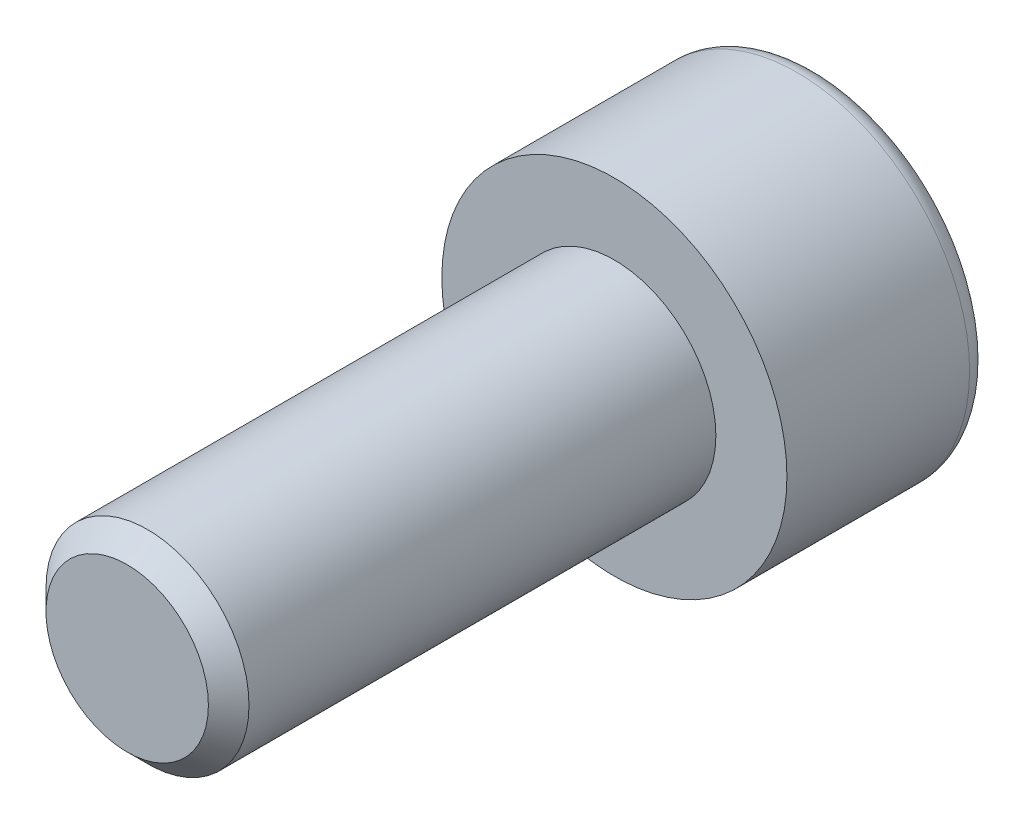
ISO-10303-21;
HEADER;
FILE_DESCRIPTION(('STEP AP214'),'2;1');
FILE_NAME('part.step','',(''),(''),'','','');
FILE_SCHEMA(('AUTOMOTIVE_DESIGN { 1 0 10303 214 1 1 1 1 }'));
ENDSEC;
DATA;
#1=APPLICATION_CONTEXT('core data for automotive mechanical design processes');
#2=APPLICATION_PROTOCOL_DEFINITION('international standard','automotive_design',2000,#1);
#3=PRODUCT_CONTEXT('',#1,'mechanical');
#4=PRODUCT('Part','Part','',(#3));
#5=PRODUCT_RELATED_PRODUCT_CATEGORY('part','',(#4));
#6=PRODUCT_DEFINITION_FORMATION('','',#4);
#7=PRODUCT_DEFINITION_CONTEXT('part definition',#1,'design');
#8=PRODUCT_DEFINITION('design','',#6,#7);
#9=PRODUCT_DEFINITION_SHAPE('','',#8);
#10=(LENGTH_UNIT() NAMED_UNIT(*) SI_UNIT(.MILLI.,.METRE.));
#11=(NAMED_UNIT(*) PLANE_ANGLE_UNIT() SI_UNIT($,.RADIAN.));
#12=(NAMED_UNIT(*) SI_UNIT($,.STERADIAN.) SOLID_ANGLE_UNIT());
#13=UNCERTAINTY_MEASURE_WITH_UNIT(LENGTH_MEASURE(1.E-05),#10,'distance_accuracy_value','');
#14=(GEOMETRIC_REPRESENTATION_CONTEXT(3) GLOBAL_UNCERTAINTY_ASSIGNED_CONTEXT((#13)) GLOBAL_UNIT_ASSIGNED_CONTEXT((#10,
#11,#12)) REPRESENTATION_CONTEXT('',''));
#15=CARTESIAN_POINT('',(0.,0.,0.));
#16=DIRECTION('',(0.,0.,1.));
#17=DIRECTION('',(1.,0.,0.));
#18=AXIS2_PLACEMENT_3D('',#15,#16,#17);
#19=CARTESIAN_POINT('',(0.,0.,-5.));
#20=DIRECTION('',(0.,0.,1.));
#21=DIRECTION('',(1.,0.,0.));
#22=AXIS2_PLACEMENT_3D('',#19,#20,#21);
#23=PLANE('',#22);
#24=CARTESIAN_POINT('',(0.,0.,-5.));
#25=DIRECTION('',(0.,0.,-1.));
#26=DIRECTION('',(-1.,0.,0.));
#27=AXIS2_PLACEMENT_3D('',#24,#25,#26);
#28=CIRCLE('',#27,3.75);
#29=CARTESIAN_POINT('',(-3.75,0.,-5.));
#30=VERTEX_POINT('',#29);
#31=EDGE_CURVE('E141',#30,#30,#28,.T.);
#32=ORIENTED_EDGE('',*,*,#31,.T.);
#33=EDGE_LOOP('',(#32));
#34=FACE_BOUND('',#33,.T.);
#35=DIRECTION('',(-0.86602540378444,0.499999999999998,0.));
#36=VECTOR('',#35,1.);
#37=CARTESIAN_POINT('',(0.,2.3094010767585,-5.));
#38=LINE('',#37,#36);
#39=CARTESIAN_POINT('',(2.,1.15470053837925,-5.));
#40=VERTEX_POINT('',#39);
#41=CARTESIAN_POINT('',(0.,2.3094010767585,-5.));
#42=VERTEX_POINT('',#41);
#43=EDGE_CURVE('E45',#40,#42,#38,.T.);
#44=ORIENTED_EDGE('',*,*,#43,.T.);
#45=DIRECTION('',(-0.866025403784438,-0.500000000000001,0.));
#46=VECTOR('',#45,1.);
#47=CARTESIAN_POINT('',(0.,2.3094010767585,-5.));
#48=LINE('',#47,#46);
#49=CARTESIAN_POINT('',(-2.,1.15470053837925,-5.));
#50=VERTEX_POINT('',#49);
#51=EDGE_CURVE('E85',#42,#50,#48,.T.);
#52=ORIENTED_EDGE('',*,*,#51,.T.);
#53=DIRECTION('',(0.,-1.,0.));
#54=VECTOR('',#53,1.);
#55=CARTESIAN_POINT('',(-2.,-1.15470053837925,-5.));
#56=LINE('',#55,#54);
#57=CARTESIAN_POINT('',(-2.,-1.15470053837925,-5.));
#58=VERTEX_POINT('',#57);
#59=EDGE_CURVE('E93',#50,#58,#56,.T.);
#60=ORIENTED_EDGE('',*,*,#59,.T.);
#61=DIRECTION('',(0.866025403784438,-0.500000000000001,0.));
#62=VECTOR('',#61,1.);
#63=CARTESIAN_POINT('',(0.,-2.3094010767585,-5.));
#64=LINE('',#63,#62);
#65=CARTESIAN_POINT('',(0.,-2.3094010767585,-5.));
#66=VERTEX_POINT('',#65);
#67=EDGE_CURVE('E111',#58,#66,#64,.T.);
#68=ORIENTED_EDGE('',*,*,#67,.T.);
#69=DIRECTION('',(0.86602540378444,0.499999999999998,0.));
#70=VECTOR('',#69,1.);
#71=CARTESIAN_POINT('',(0.,-2.3094010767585,-5.));
#72=LINE('',#71,#70);
#73=CARTESIAN_POINT('',(2.,-1.15470053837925,-5.));
#74=VERTEX_POINT('',#73);
#75=EDGE_CURVE('E114',#66,#74,#72,.T.);
#76=ORIENTED_EDGE('',*,*,#75,.T.);
#77=DIRECTION('',(0.,1.,0.));
#78=VECTOR('',#77,1.);
#79=CARTESIAN_POINT('',(2.,-1.15470053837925,-5.));
#80=LINE('',#79,#78);
#81=EDGE_CURVE('E104',#74,#40,#80,.T.);
#82=ORIENTED_EDGE('',*,*,#81,.T.);
#83=EDGE_LOOP('',(#44,#52,#60,#68,#76,#82));
#84=FACE_BOUND('',#83,.T.);
#85=ADVANCED_FACE('F31',(#34,#84),#23,.F.);
#86=CARTESIAN_POINT('',(0.,0.,-4.5));
#87=DIRECTION('',(0.,0.,-1.));
#88=DIRECTION('',(-1.,0.,0.));
#89=AXIS2_PLACEMENT_3D('',#86,#87,#88);
#90=TOROIDAL_SURFACE('',#89,3.75,0.5);
#91=ORIENTED_EDGE('',*,*,#31,.F.);
#92=EDGE_LOOP('',(#91));
#93=FACE_BOUND('',#92,.T.);
#94=CARTESIAN_POINT('',(0.,0.,-4.5));
#95=DIRECTION('',(0.,0.,-1.));
#96=DIRECTION('',(-1.,0.,0.));
#97=AXIS2_PLACEMENT_3D('',#94,#95,#96);
#98=CIRCLE('',#97,4.25);
#99=CARTESIAN_POINT('',(-4.25,0.,-4.5));
#100=VERTEX_POINT('',#99);
#101=EDGE_CURVE('E138',#100,#100,#98,.T.);
#102=ORIENTED_EDGE('',*,*,#101,.T.);
#103=EDGE_LOOP('',(#102));
#104=FACE_BOUND('',#103,.T.);
#105=ADVANCED_FACE('F160',(#93,#104),#90,.T.);
#106=CARTESIAN_POINT('',(0.,0.,0.));
#107=DIRECTION('',(0.,0.,-1.));
#108=DIRECTION('',(-1.,0.,0.));
#109=AXIS2_PLACEMENT_3D('',#106,#107,#108);
#110=CYLINDRICAL_SURFACE('',#109,4.25);
#111=ORIENTED_EDGE('',*,*,#101,.F.);
#112=EDGE_LOOP('',(#111));
#113=FACE_BOUND('',#112,.T.);
#114=CARTESIAN_POINT('',(0.,0.,0.));
#115=DIRECTION('',(0.,0.,-1.));
#116=DIRECTION('',(-1.,0.,0.));
#117=AXIS2_PLACEMENT_3D('',#114,#115,#116);
#118=CIRCLE('',#117,4.25);
#119=CARTESIAN_POINT('',(-4.25,0.,0.));
#120=VERTEX_POINT('',#119);
#121=EDGE_CURVE('E99',#120,#120,#118,.T.);
#122=ORIENTED_EDGE('',*,*,#121,.T.);
#123=EDGE_LOOP('',(#122));
#124=FACE_BOUND('',#123,.T.);
#125=ADVANCED_FACE('F165',(#113,#124),#110,.T.);
#126=CARTESIAN_POINT('',(0.,0.,0.));
#127=DIRECTION('',(0.,0.,-1.));
#128=DIRECTION('',(-1.,0.,0.));
#129=AXIS2_PLACEMENT_3D('',#126,#127,#128);
#130=PLANE('',#129);
#131=CARTESIAN_POINT('',(0.,0.,0.));
#132=DIRECTION('',(0.,0.,1.));
#133=DIRECTION('',(1.,0.,0.));
#134=AXIS2_PLACEMENT_3D('',#131,#132,#133);
#135=CIRCLE('',#134,2.5);
#136=CARTESIAN_POINT('',(2.5,0.,0.));
#137=VERTEX_POINT('',#136);
#138=EDGE_CURVE('E105',#137,#137,#135,.T.);
#139=ORIENTED_EDGE('',*,*,#138,.F.);
#140=EDGE_LOOP('',(#139));
#141=FACE_BOUND('',#140,.T.);
#142=ORIENTED_EDGE('',*,*,#121,.F.);
#143=EDGE_LOOP('',(#142));
#144=FACE_BOUND('',#143,.T.);
#145=ADVANCED_FACE('F173',(#141,#144),#130,.F.);
#146=CARTESIAN_POINT('',(0.,2.3094010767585,-2.5));
#147=DIRECTION('',(-0.499999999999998,-0.86602540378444,0.));
#148=DIRECTION('',(0.86602540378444,-0.499999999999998,0.));
#149=AXIS2_PLACEMENT_3D('',#146,#147,#148);
#150=PLANE('',#149);
#151=ORIENTED_EDGE('',*,*,#43,.F.);
#152=DIRECTION('',(0.,0.,-1.));
#153=VECTOR('',#152,1.);
#154=CARTESIAN_POINT('',(2.,1.15470053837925,-2.5));
#155=LINE('',#154,#153);
#156=CARTESIAN_POINT('',(2.,1.15470053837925,-2.5));
#157=VERTEX_POINT('',#156);
#158=EDGE_CURVE('E127',#157,#40,#155,.T.);
#159=ORIENTED_EDGE('',*,*,#158,.F.);
#160=DIRECTION('',(-0.86602540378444,0.499999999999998,0.));
#161=VECTOR('',#160,1.);
#162=CARTESIAN_POINT('',(0.,2.3094010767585,-2.5));
#163=LINE('',#162,#161);
#164=CARTESIAN_POINT('',(0.,2.3094010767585,-2.5));
#165=VERTEX_POINT('',#164);
#166=EDGE_CURVE('E98',#157,#165,#163,.T.);
#167=ORIENTED_EDGE('',*,*,#166,.T.);
#168=DIRECTION('',(0.,0.,-1.));
#169=VECTOR('',#168,1.);
#170=CARTESIAN_POINT('',(0.,2.3094010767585,-2.5));
#171=LINE('',#170,#169);
#172=EDGE_CURVE('E87',#165,#42,#171,.T.);
#173=ORIENTED_EDGE('',*,*,#172,.T.);
#174=EDGE_LOOP('',(#151,#159,#167,#173));
#175=FACE_BOUND('',#174,.T.);
#176=ADVANCED_FACE('F96',(#175),#150,.T.);
#177=CARTESIAN_POINT('',(0.,2.3094010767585,-2.5));
#178=DIRECTION('',(0.500000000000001,-0.866025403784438,0.));
#179=DIRECTION('',(0.866025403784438,0.500000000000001,0.));
#180=AXIS2_PLACEMENT_3D('',#177,#178,#179);
#181=PLANE('',#180);
#182=ORIENTED_EDGE('',*,*,#51,.F.);
#183=ORIENTED_EDGE('',*,*,#172,.F.);
#184=DIRECTION('',(-0.866025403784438,-0.500000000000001,0.));
#185=VECTOR('',#184,1.);
#186=CARTESIAN_POINT('',(0.,2.3094010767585,-2.5));
#187=LINE('',#186,#185);
#188=CARTESIAN_POINT('',(-2.,1.15470053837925,-2.5));
#189=VERTEX_POINT('',#188);
#190=EDGE_CURVE('E118',#165,#189,#187,.T.);
#191=ORIENTED_EDGE('',*,*,#190,.T.);
#192=DIRECTION('',(0.,0.,-1.));
#193=VECTOR('',#192,1.);
#194=CARTESIAN_POINT('',(-2.,1.15470053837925,-2.5));
#195=LINE('',#194,#193);
#196=EDGE_CURVE('E89',#189,#50,#195,.T.);
#197=ORIENTED_EDGE('',*,*,#196,.T.);
#198=EDGE_LOOP('',(#182,#183,#191,#197));
#199=FACE_BOUND('',#198,.T.);
#200=ADVANCED_FACE('F86',(#199),#181,.T.);
#201=CARTESIAN_POINT('',(-2.,-1.15470053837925,-2.5));
#202=DIRECTION('',(1.,0.,0.));
#203=DIRECTION('',(0.,0.,-1.));
#204=AXIS2_PLACEMENT_3D('',#201,#202,#203);
#205=PLANE('',#204);
#206=ORIENTED_EDGE('',*,*,#59,.F.);
#207=ORIENTED_EDGE('',*,*,#196,.F.);
#208=DIRECTION('',(0.,-1.,0.));
#209=VECTOR('',#208,1.);
#210=CARTESIAN_POINT('',(-2.,-1.15470053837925,-2.5));
#211=LINE('',#210,#209);
#212=CARTESIAN_POINT('',(-2.,-1.15470053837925,-2.5));
#213=VERTEX_POINT('',#212);
#214=EDGE_CURVE('E120',#189,#213,#211,.T.);
#215=ORIENTED_EDGE('',*,*,#214,.T.);
#216=DIRECTION('',(0.,0.,-1.));
#217=VECTOR('',#216,1.);
#218=CARTESIAN_POINT('',(-2.,-1.15470053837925,-2.5));
#219=LINE('',#218,#217);
#220=EDGE_CURVE('E133',#213,#58,#219,.T.);
#221=ORIENTED_EDGE('',*,*,#220,.T.);
#222=EDGE_LOOP('',(#206,#207,#215,#221));
#223=FACE_BOUND('',#222,.T.);
#224=ADVANCED_FACE('F188',(#223),#205,.T.);
#225=CARTESIAN_POINT('',(0.,-2.3094010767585,-2.5));
#226=DIRECTION('',(0.500000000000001,0.866025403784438,0.));
#227=DIRECTION('',(-0.866025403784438,0.500000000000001,0.));
#228=AXIS2_PLACEMENT_3D('',#225,#226,#227);
#229=PLANE('',#228);
#230=ORIENTED_EDGE('',*,*,#67,.F.);
#231=ORIENTED_EDGE('',*,*,#220,.F.);
#232=DIRECTION('',(0.866025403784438,-0.500000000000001,0.));
#233=VECTOR('',#232,1.);
#234=CARTESIAN_POINT('',(0.,-2.3094010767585,-2.5));
#235=LINE('',#234,#233);
#236=CARTESIAN_POINT('',(0.,-2.3094010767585,-2.5));
#237=VERTEX_POINT('',#236);
#238=EDGE_CURVE('E122',#213,#237,#235,.T.);
#239=ORIENTED_EDGE('',*,*,#238,.T.);
#240=DIRECTION('',(0.,0.,-1.));
#241=VECTOR('',#240,1.);
#242=CARTESIAN_POINT('',(0.,-2.3094010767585,-2.5));
#243=LINE('',#242,#241);
#244=EDGE_CURVE('E131',#237,#66,#243,.T.);
#245=ORIENTED_EDGE('',*,*,#244,.T.);
#246=EDGE_LOOP('',(#230,#231,#239,#245));
#247=FACE_BOUND('',#246,.T.);
#248=ADVANCED_FACE('F191',(#247),#229,.T.);
#249=CARTESIAN_POINT('',(0.,-2.3094010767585,-2.5));
#250=DIRECTION('',(-0.499999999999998,0.86602540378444,0.));
#251=DIRECTION('',(-0.86602540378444,-0.499999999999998,0.));
#252=AXIS2_PLACEMENT_3D('',#249,#250,#251);
#253=PLANE('',#252);
#254=ORIENTED_EDGE('',*,*,#75,.F.);
#255=ORIENTED_EDGE('',*,*,#244,.F.);
#256=DIRECTION('',(0.86602540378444,0.499999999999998,0.));
#257=VECTOR('',#256,1.);
#258=CARTESIAN_POINT('',(0.,-2.3094010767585,-2.5));
#259=LINE('',#258,#257);
#260=CARTESIAN_POINT('',(2.,-1.15470053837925,-2.5));
#261=VERTEX_POINT('',#260);
#262=EDGE_CURVE('E124',#237,#261,#259,.T.);
#263=ORIENTED_EDGE('',*,*,#262,.T.);
#264=DIRECTION('',(0.,0.,-1.));
#265=VECTOR('',#264,1.);
#266=CARTESIAN_POINT('',(2.,-1.15470053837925,-2.5));
#267=LINE('',#266,#265);
#268=EDGE_CURVE('E129',#261,#74,#267,.T.);
#269=ORIENTED_EDGE('',*,*,#268,.T.);
#270=EDGE_LOOP('',(#254,#255,#263,#269));
#271=FACE_BOUND('',#270,.T.);
#272=ADVANCED_FACE('F195',(#271),#253,.T.);
#273=CARTESIAN_POINT('',(2.,-1.15470053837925,-2.5));
#274=DIRECTION('',(-1.,0.,0.));
#275=DIRECTION('',(0.,0.,1.));
#276=AXIS2_PLACEMENT_3D('',#273,#274,#275);
#277=PLANE('',#276);
#278=ORIENTED_EDGE('',*,*,#81,.F.);
#279=ORIENTED_EDGE('',*,*,#268,.F.);
#280=DIRECTION('',(0.,1.,0.));
#281=VECTOR('',#280,1.);
#282=CARTESIAN_POINT('',(2.,-1.15470053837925,-2.5));
#283=LINE('',#282,#281);
#284=EDGE_CURVE('E52',#261,#157,#283,.T.);
#285=ORIENTED_EDGE('',*,*,#284,.T.);
#286=ORIENTED_EDGE('',*,*,#158,.T.);
#287=EDGE_LOOP('',(#278,#279,#285,#286));
#288=FACE_BOUND('',#287,.T.);
#289=ADVANCED_FACE('F199',(#288),#277,.T.);
#290=CARTESIAN_POINT('',(2.,1.15470053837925,-2.5));
#291=DIRECTION('',(0.,0.,1.));
#292=DIRECTION('',(1.,0.,0.));
#293=AXIS2_PLACEMENT_3D('',#290,#291,#292);
#294=PLANE('',#293);
#295=ORIENTED_EDGE('',*,*,#166,.F.);
#296=ORIENTED_EDGE('',*,*,#284,.F.);
#297=ORIENTED_EDGE('',*,*,#262,.F.);
#298=ORIENTED_EDGE('',*,*,#238,.F.);
#299=ORIENTED_EDGE('',*,*,#214,.F.);
#300=ORIENTED_EDGE('',*,*,#190,.F.);
#301=EDGE_LOOP('',(#295,#296,#297,#298,#299,#300));
#302=FACE_BOUND('',#301,.T.);
#303=ADVANCED_FACE('F203',(#302),#294,.F.);
#304=CARTESIAN_POINT('',(0.,0.,12.));
#305=DIRECTION('',(0.,0.,1.));
#306=DIRECTION('',(1.,0.,0.));
#307=AXIS2_PLACEMENT_3D('',#304,#305,#306);
#308=PLANE('',#307);
#309=CARTESIAN_POINT('',(0.,0.,12.));
#310=DIRECTION('',(0.,0.,1.));
#311=DIRECTION('',(1.,0.,0.));
#312=AXIS2_PLACEMENT_3D('',#309,#310,#311);
#313=CIRCLE('',#312,2.);
#314=CARTESIAN_POINT('',(2.,0.,12.));
#315=VERTEX_POINT('',#314);
#316=EDGE_CURVE('E38',#315,#315,#313,.T.);
#317=ORIENTED_EDGE('',*,*,#316,.T.);
#318=EDGE_LOOP('',(#317));
#319=FACE_BOUND('',#318,.T.);
#320=ADVANCED_FACE('F146',(#319),#308,.T.);
#321=CARTESIAN_POINT('',(0.,0.,0.));
#322=DIRECTION('',(0.,0.,1.));
#323=DIRECTION('',(1.,0.,0.));
#324=AXIS2_PLACEMENT_3D('',#321,#322,#323);
#325=CYLINDRICAL_SURFACE('',#324,2.5);
#326=CARTESIAN_POINT('',(0.,0.,11.5));
#327=DIRECTION('',(0.,0.,1.));
#328=DIRECTION('',(1.,0.,0.));
#329=AXIS2_PLACEMENT_3D('',#326,#327,#328);
#330=CIRCLE('',#329,2.5);
#331=CARTESIAN_POINT('',(2.5,0.,11.5));
#332=VERTEX_POINT('',#331);
#333=EDGE_CURVE('E11',#332,#332,#330,.F.);
#334=ORIENTED_EDGE('',*,*,#333,.T.);
#335=EDGE_LOOP('',(#334));
#336=FACE_BOUND('',#335,.T.);
#337=ORIENTED_EDGE('',*,*,#138,.T.);
#338=EDGE_LOOP('',(#337));
#339=FACE_BOUND('',#338,.T.);
#340=ADVANCED_FACE('F150',(#336,#339),#325,.T.);
#341=CARTESIAN_POINT('',(0.,0.,12.));
#342=DIRECTION('',(0.,0.,-1.));
#343=DIRECTION('',(-1.,0.,0.));
#344=AXIS2_PLACEMENT_3D('',#341,#342,#343);
#345=CONICAL_SURFACE('',#344,2.,0.785398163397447);
#346=ORIENTED_EDGE('',*,*,#333,.F.);
#347=EDGE_LOOP('',(#346));
#348=FACE_BOUND('',#347,.T.);
#349=ORIENTED_EDGE('',*,*,#316,.F.);
#350=EDGE_LOOP('',(#349));
#351=FACE_BOUND('',#350,.T.);
#352=ADVANCED_FACE('F148',(#348,#351),#345,.T.);
#353=CLOSED_SHELL('',(#85,#105,#125,#145,#176,#200,#224,#248,#272,#289,#303,#320,#340,#352));
#354=MANIFOLD_SOLID_BREP('B2',#353);
#355=ADVANCED_BREP_SHAPE_REPRESENTATION('',(#18,#354),#14);
#356=SHAPE_DEFINITION_REPRESENTATION(#9,#355);
ENDSEC;
END-ISO-10303-21;
